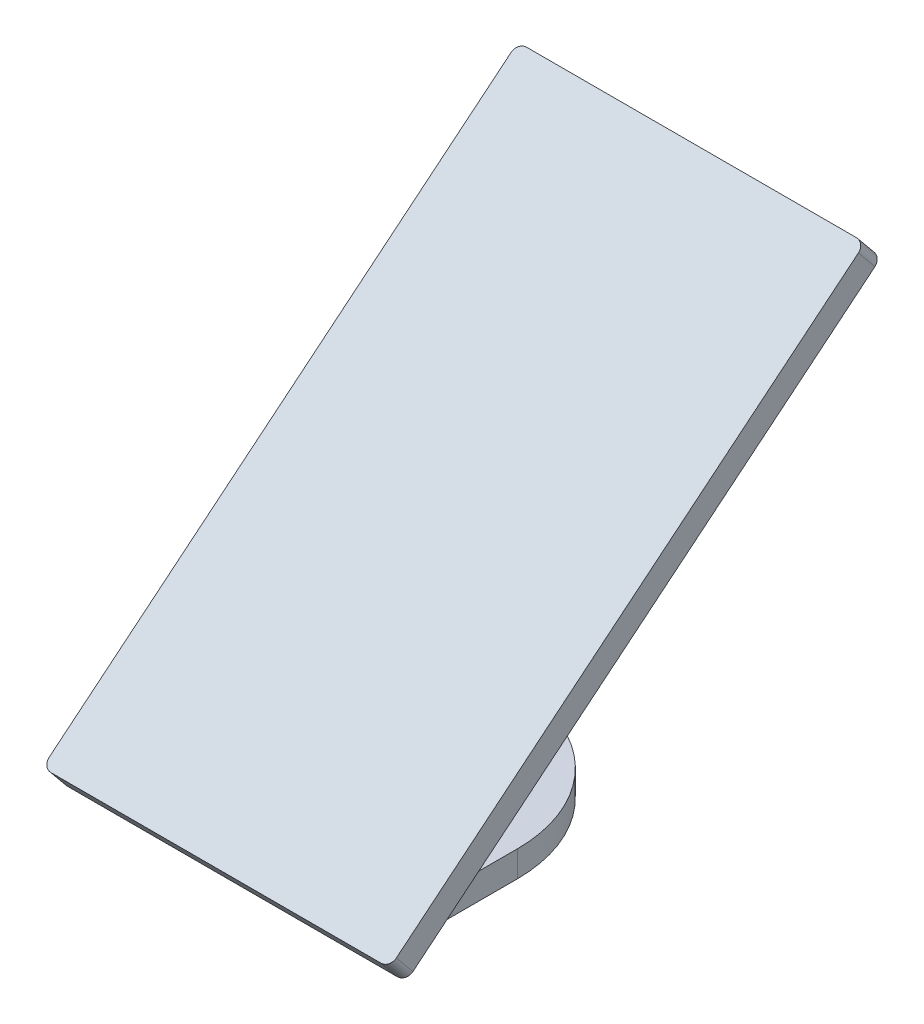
ISO-10303-21;
HEADER;
FILE_DESCRIPTION(('STEP AP214'),'2;1');
FILE_NAME('part.step','',(''),(''),'','','');
FILE_SCHEMA(('AUTOMOTIVE_DESIGN { 1 0 10303 214 1 1 1 1 }'));
ENDSEC;
DATA;
#1=APPLICATION_CONTEXT('core data for automotive mechanical design processes');
#2=APPLICATION_PROTOCOL_DEFINITION('international standard','automotive_design',2000,#1);
#3=PRODUCT_CONTEXT('',#1,'mechanical');
#4=PRODUCT('Part','Part','',(#3));
#5=PRODUCT_RELATED_PRODUCT_CATEGORY('part','',(#4));
#6=PRODUCT_DEFINITION_FORMATION('','',#4);
#7=PRODUCT_DEFINITION_CONTEXT('part definition',#1,'design');
#8=PRODUCT_DEFINITION('design','',#6,#7);
#9=PRODUCT_DEFINITION_SHAPE('','',#8);
#10=(LENGTH_UNIT() NAMED_UNIT(*) SI_UNIT(.MILLI.,.METRE.));
#11=(NAMED_UNIT(*) PLANE_ANGLE_UNIT() SI_UNIT($,.RADIAN.));
#12=(NAMED_UNIT(*) SI_UNIT($,.STERADIAN.) SOLID_ANGLE_UNIT());
#13=UNCERTAINTY_MEASURE_WITH_UNIT(LENGTH_MEASURE(1.E-05),#10,'distance_accuracy_value','');
#14=(GEOMETRIC_REPRESENTATION_CONTEXT(3) GLOBAL_UNCERTAINTY_ASSIGNED_CONTEXT((#13)) GLOBAL_UNIT_ASSIGNED_CONTEXT((#10,
#11,#12)) REPRESENTATION_CONTEXT('',''));
#15=CARTESIAN_POINT('',(0.,0.,0.));
#16=DIRECTION('',(0.,0.,1.));
#17=DIRECTION('',(1.,0.,0.));
#18=AXIS2_PLACEMENT_3D('',#15,#16,#17);
#19=CARTESIAN_POINT('',(-15.24,34.2757016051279,-29.0279220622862));
#20=DIRECTION('',(0.,-0.772733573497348,-0.634730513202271));
#21=DIRECTION('',(0.,0.634730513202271,-0.772733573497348));
#22=AXIS2_PLACEMENT_3D('',#19,#20,#21);
#23=PLANE('',#22);
#24=DIRECTION('',(-1.,0.,0.));
#25=VECTOR('',#24,1.);
#26=CARTESIAN_POINT('',(-15.24,0.,12.7));
#27=LINE('',#26,#25);
#28=CARTESIAN_POINT('',(-12.2936,0.,12.7));
#29=VERTEX_POINT('',#28);
#30=CARTESIAN_POINT('',(-14.478,0.,12.7));
#31=VERTEX_POINT('',#30);
#32=EDGE_CURVE('E278',#29,#31,#27,.T.);
#33=ORIENTED_EDGE('',*,*,#32,.T.);
#34=CARTESIAN_POINT('',(-14.478,0.483664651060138,12.111177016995));
#35=DIRECTION('',(0.,-0.772733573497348,-0.634730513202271));
#36=DIRECTION('',(0.,0.634730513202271,-0.772733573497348));
#37=AXIS2_PLACEMENT_3D('',#34,#35,#36);
#38=CIRCLE('',#37,0.762);
#39=CARTESIAN_POINT('',(-15.24,0.48366465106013,12.111177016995));
#40=VERTEX_POINT('',#39);
#41=EDGE_CURVE('E238',#31,#40,#38,.T.);
#42=ORIENTED_EDGE('',*,*,#41,.T.);
#43=DIRECTION('',(0.,0.634730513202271,-0.772733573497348));
#44=VECTOR('',#43,1.);
#45=CARTESIAN_POINT('',(-15.24,0.,12.7));
#46=LINE('',#45,#44);
#47=CARTESIAN_POINT('',(-15.24,33.7920369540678,-28.4390990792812));
#48=VERTEX_POINT('',#47);
#49=EDGE_CURVE('E202',#40,#48,#46,.T.);
#50=ORIENTED_EDGE('',*,*,#49,.T.);
#51=CARTESIAN_POINT('',(-14.478,33.7920369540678,-28.4390990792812));
#52=DIRECTION('',(0.,-0.772733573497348,-0.634730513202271));
#53=DIRECTION('',(0.,0.634730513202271,-0.772733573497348));
#54=AXIS2_PLACEMENT_3D('',#51,#52,#53);
#55=CIRCLE('',#54,0.762);
#56=CARTESIAN_POINT('',(-14.478,34.2757016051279,-29.0279220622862));
#57=VERTEX_POINT('',#56);
#58=EDGE_CURVE('E232',#48,#57,#55,.T.);
#59=ORIENTED_EDGE('',*,*,#58,.T.);
#60=DIRECTION('',(1.,0.,0.));
#61=VECTOR('',#60,1.);
#62=CARTESIAN_POINT('',(-15.24,34.2757016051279,-29.0279220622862));
#63=LINE('',#62,#61);
#64=CARTESIAN_POINT('',(-2.54,34.2757016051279,-29.0279220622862));
#65=VERTEX_POINT('',#64);
#66=EDGE_CURVE('E228',#57,#65,#63,.T.);
#67=ORIENTED_EDGE('',*,*,#66,.T.);
#68=DIRECTION('',(0.,-0.634730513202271,0.772733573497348));
#69=VECTOR('',#68,1.);
#70=CARTESIAN_POINT('',(-2.54,34.2757016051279,-29.0279220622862));
#71=LINE('',#70,#69);
#72=CARTESIAN_POINT('',(-2.54,12.9706237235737,-3.09069575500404));
#73=VERTEX_POINT('',#72);
#74=EDGE_CURVE('E183',#65,#73,#71,.T.);
#75=ORIENTED_EDGE('',*,*,#74,.T.);
#76=CARTESIAN_POINT('',(0.,10.4318976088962,0.));
#77=DIRECTION('',(0.,-0.772733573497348,-0.634730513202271));
#78=DIRECTION('',(0.,-0.634730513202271,0.772733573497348));
#79=AXIS2_PLACEMENT_3D('',#76,#77,#78);
#80=ELLIPSE('',#79,5.17707543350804,4.0005);
#81=CARTESIAN_POINT('',(2.54000000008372,12.9706237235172,-3.09069575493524));
#82=VERTEX_POINT('',#81);
#83=EDGE_CURVE('E198',#82,#73,#80,.T.);
#84=ORIENTED_EDGE('',*,*,#83,.F.);
#85=DIRECTION('',(0.,-0.634730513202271,0.772733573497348));
#86=VECTOR('',#85,1.);
#87=CARTESIAN_POINT('',(2.54,34.2757016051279,-29.0279220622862));
#88=LINE('',#87,#86);
#89=CARTESIAN_POINT('',(2.53999999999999,34.2757016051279,-29.0279220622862));
#90=VERTEX_POINT('',#89);
#91=EDGE_CURVE('E153',#90,#82,#88,.T.);
#92=ORIENTED_EDGE('',*,*,#91,.F.);
#93=CARTESIAN_POINT('',(14.478,34.2757016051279,-29.0279220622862));
#94=VERTEX_POINT('',#93);
#95=EDGE_CURVE('E219',#90,#94,#63,.T.);
#96=ORIENTED_EDGE('',*,*,#95,.T.);
#97=CARTESIAN_POINT('',(14.478,33.7920369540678,-28.4390990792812));
#98=DIRECTION('',(0.,-0.772733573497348,-0.634730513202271));
#99=DIRECTION('',(0.,0.634730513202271,-0.772733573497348));
#100=AXIS2_PLACEMENT_3D('',#97,#98,#99);
#101=CIRCLE('',#100,0.762);
#102=CARTESIAN_POINT('',(15.24,33.7920369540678,-28.4390990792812));
#103=VERTEX_POINT('',#102);
#104=EDGE_CURVE('E234',#94,#103,#101,.T.);
#105=ORIENTED_EDGE('',*,*,#104,.T.);
#106=DIRECTION('',(0.,-0.634730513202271,0.772733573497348));
#107=VECTOR('',#106,1.);
#108=CARTESIAN_POINT('',(15.24,0.,12.7));
#109=LINE('',#108,#107);
#110=CARTESIAN_POINT('',(15.24,0.48366465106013,12.111177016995));
#111=VERTEX_POINT('',#110);
#112=EDGE_CURVE('E222',#103,#111,#109,.T.);
#113=ORIENTED_EDGE('',*,*,#112,.T.);
#114=CARTESIAN_POINT('',(14.478,0.483664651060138,12.111177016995));
#115=DIRECTION('',(0.,-0.772733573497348,-0.634730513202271));
#116=DIRECTION('',(0.,0.634730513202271,-0.772733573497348));
#117=AXIS2_PLACEMENT_3D('',#114,#115,#116);
#118=CIRCLE('',#117,0.762);
#119=CARTESIAN_POINT('',(14.478,0.,12.7));
#120=VERTEX_POINT('',#119);
#121=EDGE_CURVE('E236',#111,#120,#118,.T.);
#122=ORIENTED_EDGE('',*,*,#121,.T.);
#123=CARTESIAN_POINT('',(12.2936,0.,12.7));
#124=VERTEX_POINT('',#123);
#125=EDGE_CURVE('E207',#120,#124,#27,.T.);
#126=ORIENTED_EDGE('',*,*,#125,.T.);
#127=DIRECTION('',(0.,-0.634730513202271,0.772733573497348));
#128=VECTOR('',#127,1.);
#129=CARTESIAN_POINT('',(12.2936,0.920990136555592,11.5787682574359));
#130=LINE('',#129,#128);
#131=CARTESIAN_POINT('',(12.2936,2.286,9.91697805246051));
#132=VERTEX_POINT('',#131);
#133=EDGE_CURVE('E290',#132,#124,#130,.T.);
#134=ORIENTED_EDGE('',*,*,#133,.F.);
#135=DIRECTION('',(-1.,0.,0.));
#136=VECTOR('',#135,1.);
#137=CARTESIAN_POINT('',(0.,2.286,9.91697805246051));
#138=LINE('',#137,#136);
#139=CARTESIAN_POINT('',(-12.2936,2.286,9.91697805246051));
#140=VERTEX_POINT('',#139);
#141=EDGE_CURVE('E216',#132,#140,#138,.T.);
#142=ORIENTED_EDGE('',*,*,#141,.T.);
#143=DIRECTION('',(0.,0.634730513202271,-0.772733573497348));
#144=VECTOR('',#143,1.);
#145=CARTESIAN_POINT('',(-12.2936,7.15005537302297,3.99538012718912));
#146=LINE('',#145,#144);
#147=EDGE_CURVE('E338',#29,#140,#146,.T.);
#148=ORIENTED_EDGE('',*,*,#147,.F.);
#149=EDGE_LOOP('',(#33,#42,#50,#59,#67,#75,#84,#92,#96,#105,#113,#122,#126,#134,#142,#148));
#150=FACE_BOUND('',#149,.T.);
#151=ADVANCED_FACE('F34',(#150),#23,.T.);
#152=CARTESIAN_POINT('',(0.,500000.,0.));
#153=DIRECTION('',(0.,-1.,0.));
#154=DIRECTION('',(0.,0.,-1.));
#155=AXIS2_PLACEMENT_3D('',#152,#153,#154);
#156=CYLINDRICAL_SURFACE('',#155,4.0005);
#157=DIRECTION('',(0.,-1.,0.));
#158=VECTOR('',#157,1.);
#159=CARTESIAN_POINT('',(2.54000000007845,500000.,-3.09069575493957));
#160=LINE('',#159,#158);
#161=CARTESIAN_POINT('',(2.53999999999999,2.286,-3.09069575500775));
#162=VERTEX_POINT('',#161);
#163=EDGE_CURVE('E148',#162,#82,#160,.F.);
#164=ORIENTED_EDGE('',*,*,#163,.T.);
#165=ORIENTED_EDGE('',*,*,#83,.T.);
#166=DIRECTION('',(0.,-1.,0.));
#167=VECTOR('',#166,1.);
#168=CARTESIAN_POINT('',(-2.53999999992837,500000.,-3.09069575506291));
#169=LINE('',#168,#167);
#170=CARTESIAN_POINT('',(-2.54000000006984,2.286,-3.09069575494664));
#171=VERTEX_POINT('',#170);
#172=EDGE_CURVE('E163',#171,#73,#169,.F.);
#173=ORIENTED_EDGE('',*,*,#172,.F.);
#174=CARTESIAN_POINT('',(0.,2.286,0.));
#175=DIRECTION('',(0.,1.,0.));
#176=DIRECTION('',(0.,0.,1.));
#177=AXIS2_PLACEMENT_3D('',#174,#175,#176);
#178=CIRCLE('',#177,4.0005);
#179=EDGE_CURVE('E160',#171,#162,#178,.T.);
#180=ORIENTED_EDGE('',*,*,#179,.T.);
#181=EDGE_LOOP('',(#164,#165,#173,#180));
#182=FACE_BOUND('',#181,.T.);
#183=ADVANCED_FACE('F161',(#182),#156,.T.);
#184=CARTESIAN_POINT('',(0.,2.286,0.));
#185=DIRECTION('',(0.,1.,0.));
#186=DIRECTION('',(0.,0.,1.));
#187=AXIS2_PLACEMENT_3D('',#184,#185,#186);
#188=PLANE('',#187);
#189=DIRECTION('',(0.,0.,-1.));
#190=VECTOR('',#189,1.);
#191=CARTESIAN_POINT('',(-2.54000000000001,2.286,-3.09069575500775));
#192=LINE('',#191,#190);
#193=CARTESIAN_POINT('',(-2.54000000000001,2.286,-4.0005));
#194=VERTEX_POINT('',#193);
#195=EDGE_CURVE('E51',#171,#194,#192,.T.);
#196=ORIENTED_EDGE('',*,*,#195,.T.);
#197=DIRECTION('',(1.,0.,0.));
#198=VECTOR('',#197,1.);
#199=CARTESIAN_POINT('',(-2.54000000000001,2.286,-4.0005));
#200=LINE('',#199,#198);
#201=CARTESIAN_POINT('',(2.53999999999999,2.286,-4.0005));
#202=VERTEX_POINT('',#201);
#203=EDGE_CURVE('E55',#194,#202,#200,.T.);
#204=ORIENTED_EDGE('',*,*,#203,.T.);
#205=DIRECTION('',(0.,0.,-1.));
#206=VECTOR('',#205,1.);
#207=CARTESIAN_POINT('',(2.53999999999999,2.286,-3.09069575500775));
#208=LINE('',#207,#206);
#209=EDGE_CURVE('E152',#162,#202,#208,.T.);
#210=ORIENTED_EDGE('',*,*,#209,.F.);
#211=ORIENTED_EDGE('',*,*,#179,.F.);
#212=EDGE_LOOP('',(#196,#204,#210,#211));
#213=FACE_BOUND('',#212,.T.);
#214=ORIENTED_EDGE('',*,*,#141,.F.);
#215=DIRECTION('',(0.,0.,-1.));
#216=VECTOR('',#215,1.);
#217=CARTESIAN_POINT('',(12.2936,2.286,12.7));
#218=LINE('',#217,#216);
#219=CARTESIAN_POINT('',(12.2936,2.286,0.));
#220=VERTEX_POINT('',#219);
#221=EDGE_CURVE('E307',#132,#220,#218,.T.);
#222=ORIENTED_EDGE('',*,*,#221,.T.);
#223=CARTESIAN_POINT('',(0.,2.286,0.));
#224=DIRECTION('',(0.,1.,0.));
#225=DIRECTION('',(0.,0.,1.));
#226=AXIS2_PLACEMENT_3D('',#223,#224,#225);
#227=CIRCLE('',#226,12.2936);
#228=CARTESIAN_POINT('',(-12.2936,2.286,0.));
#229=VERTEX_POINT('',#228);
#230=EDGE_CURVE('E310',#220,#229,#227,.T.);
#231=ORIENTED_EDGE('',*,*,#230,.T.);
#232=DIRECTION('',(0.,0.,1.));
#233=VECTOR('',#232,1.);
#234=CARTESIAN_POINT('',(-12.2936,2.286,0.));
#235=LINE('',#234,#233);
#236=EDGE_CURVE('E318',#229,#140,#235,.T.);
#237=ORIENTED_EDGE('',*,*,#236,.T.);
#238=EDGE_LOOP('',(#214,#222,#231,#237));
#239=FACE_BOUND('',#238,.T.);
#240=CARTESIAN_POINT('',(-8.3312,2.286,0.));
#241=DIRECTION('',(0.,1.,0.));
#242=DIRECTION('',(0.,0.,1.));
#243=AXIS2_PLACEMENT_3D('',#240,#241,#242);
#244=CIRCLE('',#243,1.1938);
#245=CARTESIAN_POINT('',(-8.3312,2.286,1.1938));
#246=VERTEX_POINT('',#245);
#247=EDGE_CURVE('E326',#246,#246,#244,.T.);
#248=ORIENTED_EDGE('',*,*,#247,.F.);
#249=EDGE_LOOP('',(#248));
#250=FACE_BOUND('',#249,.T.);
#251=CARTESIAN_POINT('',(0.,2.286,-8.3312));
#252=DIRECTION('',(0.,1.,0.));
#253=DIRECTION('',(0.,0.,1.));
#254=AXIS2_PLACEMENT_3D('',#251,#252,#253);
#255=CIRCLE('',#254,1.1938);
#256=CARTESIAN_POINT('',(0.,2.286,-7.1374));
#257=VERTEX_POINT('',#256);
#258=EDGE_CURVE('E165',#257,#257,#255,.T.);
#259=ORIENTED_EDGE('',*,*,#258,.F.);
#260=EDGE_LOOP('',(#259));
#261=FACE_BOUND('',#260,.T.);
#262=CARTESIAN_POINT('',(8.3312,2.286,0.));
#263=DIRECTION('',(0.,1.,0.));
#264=DIRECTION('',(0.,0.,1.));
#265=AXIS2_PLACEMENT_3D('',#262,#263,#264);
#266=CIRCLE('',#265,1.1938);
#267=CARTESIAN_POINT('',(8.3312,2.286,1.1938));
#268=VERTEX_POINT('',#267);
#269=EDGE_CURVE('E332',#268,#268,#266,.T.);
#270=ORIENTED_EDGE('',*,*,#269,.F.);
#271=EDGE_LOOP('',(#270));
#272=FACE_BOUND('',#271,.T.);
#273=ADVANCED_FACE('F167',(#213,#239,#250,#261,#272),#188,.T.);
#274=CARTESIAN_POINT('',(0.,0.,0.));
#275=DIRECTION('',(0.,1.,0.));
#276=DIRECTION('',(0.,0.,1.));
#277=AXIS2_PLACEMENT_3D('',#274,#275,#276);
#278=PLANE('',#277);
#279=CARTESIAN_POINT('',(-8.3312,0.,0.));
#280=DIRECTION('',(0.,1.,0.));
#281=DIRECTION('',(0.,0.,1.));
#282=AXIS2_PLACEMENT_3D('',#279,#280,#281);
#283=CIRCLE('',#282,1.1938);
#284=CARTESIAN_POINT('',(-8.3312,0.,1.1938));
#285=VERTEX_POINT('',#284);
#286=EDGE_CURVE('E329',#285,#285,#283,.T.);
#287=ORIENTED_EDGE('',*,*,#286,.T.);
#288=EDGE_LOOP('',(#287));
#289=FACE_BOUND('',#288,.T.);
#290=CARTESIAN_POINT('',(0.,0.,0.));
#291=DIRECTION('',(0.,1.,0.));
#292=DIRECTION('',(0.,0.,1.));
#293=AXIS2_PLACEMENT_3D('',#290,#291,#292);
#294=CIRCLE('',#293,12.2936);
#295=CARTESIAN_POINT('',(12.2936,0.,0.));
#296=VERTEX_POINT('',#295);
#297=CARTESIAN_POINT('',(-12.2936,0.,0.));
#298=VERTEX_POINT('',#297);
#299=EDGE_CURVE('E164',#296,#298,#294,.T.);
#300=ORIENTED_EDGE('',*,*,#299,.F.);
#301=DIRECTION('',(0.,0.,-1.));
#302=VECTOR('',#301,1.);
#303=CARTESIAN_POINT('',(12.2936,0.,12.7));
#304=LINE('',#303,#302);
#305=EDGE_CURVE('E308',#124,#296,#304,.T.);
#306=ORIENTED_EDGE('',*,*,#305,.F.);
#307=DIRECTION('',(1.,0.,0.));
#308=VECTOR('',#307,1.);
#309=CARTESIAN_POINT('',(-12.2936,0.,12.7));
#310=LINE('',#309,#308);
#311=EDGE_CURVE('E311',#29,#124,#310,.T.);
#312=ORIENTED_EDGE('',*,*,#311,.F.);
#313=DIRECTION('',(0.,0.,1.));
#314=VECTOR('',#313,1.);
#315=CARTESIAN_POINT('',(-12.2936,0.,0.));
#316=LINE('',#315,#314);
#317=EDGE_CURVE('E313',#298,#29,#316,.T.);
#318=ORIENTED_EDGE('',*,*,#317,.F.);
#319=EDGE_LOOP('',(#300,#306,#312,#318));
#320=FACE_BOUND('',#319,.T.);
#321=CARTESIAN_POINT('',(0.,0.,-8.3312));
#322=DIRECTION('',(0.,1.,0.));
#323=DIRECTION('',(0.,0.,1.));
#324=AXIS2_PLACEMENT_3D('',#321,#322,#323);
#325=CIRCLE('',#324,1.1938);
#326=CARTESIAN_POINT('',(0.,0.,-7.1374));
#327=VERTEX_POINT('',#326);
#328=EDGE_CURVE('E323',#327,#327,#325,.T.);
#329=ORIENTED_EDGE('',*,*,#328,.T.);
#330=EDGE_LOOP('',(#329));
#331=FACE_BOUND('',#330,.T.);
#332=CARTESIAN_POINT('',(8.3312,0.,0.));
#333=DIRECTION('',(0.,1.,0.));
#334=DIRECTION('',(0.,0.,1.));
#335=AXIS2_PLACEMENT_3D('',#332,#333,#334);
#336=CIRCLE('',#335,1.1938);
#337=CARTESIAN_POINT('',(8.3312,0.,1.1938));
#338=VERTEX_POINT('',#337);
#339=EDGE_CURVE('E335',#338,#338,#336,.T.);
#340=ORIENTED_EDGE('',*,*,#339,.T.);
#341=EDGE_LOOP('',(#340));
#342=FACE_BOUND('',#341,.T.);
#343=ADVANCED_FACE('F397',(#289,#320,#331,#342),#278,.F.);
#344=CARTESIAN_POINT('',(0.,2.286,0.));
#345=DIRECTION('',(0.,-1.,0.));
#346=DIRECTION('',(0.,0.,-1.));
#347=AXIS2_PLACEMENT_3D('',#344,#345,#346);
#348=CYLINDRICAL_SURFACE('',#347,12.2936);
#349=ORIENTED_EDGE('',*,*,#299,.T.);
#350=DIRECTION('',(0.,-1.,0.));
#351=VECTOR('',#350,1.);
#352=CARTESIAN_POINT('',(-12.2936,2.286,0.));
#353=LINE('',#352,#351);
#354=EDGE_CURVE('E294',#229,#298,#353,.T.);
#355=ORIENTED_EDGE('',*,*,#354,.F.);
#356=ORIENTED_EDGE('',*,*,#230,.F.);
#357=DIRECTION('',(0.,-1.,0.));
#358=VECTOR('',#357,1.);
#359=CARTESIAN_POINT('',(12.2936,2.286,0.));
#360=LINE('',#359,#358);
#361=EDGE_CURVE('E300',#220,#296,#360,.T.);
#362=ORIENTED_EDGE('',*,*,#361,.T.);
#363=EDGE_LOOP('',(#349,#355,#356,#362));
#364=FACE_BOUND('',#363,.T.);
#365=ADVANCED_FACE('F400',(#364),#348,.T.);
#366=CARTESIAN_POINT('',(-12.2936,2.286,0.));
#367=DIRECTION('',(1.,0.,0.));
#368=DIRECTION('',(0.,0.,-1.));
#369=AXIS2_PLACEMENT_3D('',#366,#367,#368);
#370=PLANE('',#369);
#371=ORIENTED_EDGE('',*,*,#317,.T.);
#372=ORIENTED_EDGE('',*,*,#147,.T.);
#373=ORIENTED_EDGE('',*,*,#236,.F.);
#374=ORIENTED_EDGE('',*,*,#354,.T.);
#375=EDGE_LOOP('',(#371,#372,#373,#374));
#376=FACE_BOUND('',#375,.T.);
#377=ADVANCED_FACE('F404',(#376),#370,.F.);
#378=CARTESIAN_POINT('',(12.2936,2.286,12.7));
#379=DIRECTION('',(-1.,0.,0.));
#380=DIRECTION('',(0.,0.,1.));
#381=AXIS2_PLACEMENT_3D('',#378,#379,#380);
#382=PLANE('',#381);
#383=ORIENTED_EDGE('',*,*,#221,.F.);
#384=ORIENTED_EDGE('',*,*,#133,.T.);
#385=ORIENTED_EDGE('',*,*,#305,.T.);
#386=ORIENTED_EDGE('',*,*,#361,.F.);
#387=EDGE_LOOP('',(#383,#384,#385,#386));
#388=FACE_BOUND('',#387,.T.);
#389=ADVANCED_FACE('F393',(#388),#382,.F.);
#390=CARTESIAN_POINT('',(0.,2.286,-8.3312));
#391=DIRECTION('',(0.,-1.,0.));
#392=DIRECTION('',(0.,0.,-1.));
#393=AXIS2_PLACEMENT_3D('',#390,#391,#392);
#394=CYLINDRICAL_SURFACE('',#393,1.1938);
#395=ORIENTED_EDGE('',*,*,#258,.T.);
#396=EDGE_LOOP('',(#395));
#397=FACE_BOUND('',#396,.T.);
#398=ORIENTED_EDGE('',*,*,#328,.F.);
#399=EDGE_LOOP('',(#398));
#400=FACE_BOUND('',#399,.T.);
#401=ADVANCED_FACE('F389',(#397,#400),#394,.F.);
#402=CARTESIAN_POINT('',(-8.3312,2.286,0.));
#403=DIRECTION('',(0.,-1.,0.));
#404=DIRECTION('',(0.,0.,-1.));
#405=AXIS2_PLACEMENT_3D('',#402,#403,#404);
#406=CYLINDRICAL_SURFACE('',#405,1.1938);
#407=ORIENTED_EDGE('',*,*,#247,.T.);
#408=EDGE_LOOP('',(#407));
#409=FACE_BOUND('',#408,.T.);
#410=ORIENTED_EDGE('',*,*,#286,.F.);
#411=EDGE_LOOP('',(#410));
#412=FACE_BOUND('',#411,.T.);
#413=ADVANCED_FACE('F385',(#409,#412),#406,.F.);
#414=CARTESIAN_POINT('',(8.3312,2.286,0.));
#415=DIRECTION('',(0.,-1.,0.));
#416=DIRECTION('',(0.,0.,-1.));
#417=AXIS2_PLACEMENT_3D('',#414,#415,#416);
#418=CYLINDRICAL_SURFACE('',#417,1.1938);
#419=ORIENTED_EDGE('',*,*,#269,.T.);
#420=EDGE_LOOP('',(#419));
#421=FACE_BOUND('',#420,.T.);
#422=ORIENTED_EDGE('',*,*,#339,.F.);
#423=EDGE_LOOP('',(#422));
#424=FACE_BOUND('',#423,.T.);
#425=ADVANCED_FACE('F382',(#421,#424),#418,.F.);
#426=CARTESIAN_POINT('',(-15.24,1.76646894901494,14.1509939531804));
#427=DIRECTION('',(-1.,0.,0.));
#428=DIRECTION('',(0.,0.,1.));
#429=AXIS2_PLACEMENT_3D('',#426,#427,#428);
#430=PLANE('',#429);
#431=ORIENTED_EDGE('',*,*,#49,.F.);
#432=DIRECTION('',(0.,-0.772733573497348,-0.634730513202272));
#433=VECTOR('',#432,1.);
#434=CARTESIAN_POINT('',(-15.24,2.25013360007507,13.5621709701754));
#435=LINE('',#434,#433);
#436=CARTESIAN_POINT('',(-15.24,2.25013360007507,13.5621709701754));
#437=VERTEX_POINT('',#436);
#438=EDGE_CURVE('E243',#40,#437,#435,.F.);
#439=ORIENTED_EDGE('',*,*,#438,.T.);
#440=DIRECTION('',(0.,0.634730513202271,-0.772733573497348));
#441=VECTOR('',#440,1.);
#442=CARTESIAN_POINT('',(-15.24,1.76646894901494,14.1509939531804));
#443=LINE('',#442,#441);
#444=CARTESIAN_POINT('',(-15.24,35.5585059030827,-26.9881051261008));
#445=VERTEX_POINT('',#444);
#446=EDGE_CURVE('E203',#437,#445,#443,.T.);
#447=ORIENTED_EDGE('',*,*,#446,.T.);
#448=DIRECTION('',(0.,-0.772733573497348,-0.634730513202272));
#449=VECTOR('',#448,1.);
#450=CARTESIAN_POINT('',(-15.24,35.5585059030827,-26.9881051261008));
#451=LINE('',#450,#449);
#452=EDGE_CURVE('E240',#445,#48,#451,.T.);
#453=ORIENTED_EDGE('',*,*,#452,.T.);
#454=EDGE_LOOP('',(#431,#439,#447,#453));
#455=FACE_BOUND('',#454,.T.);
#456=ADVANCED_FACE('F273',(#455),#430,.T.);
#457=CARTESIAN_POINT('',(-15.24,1.76646894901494,14.1509939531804));
#458=DIRECTION('',(0.,-0.634730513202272,0.772733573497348));
#459=DIRECTION('',(0.,-0.772733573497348,-0.634730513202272));
#460=AXIS2_PLACEMENT_3D('',#457,#458,#459);
#461=PLANE('',#460);
#462=DIRECTION('',(-1.,0.,0.));
#463=VECTOR('',#462,1.);
#464=CARTESIAN_POINT('',(-15.24,1.76646894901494,14.1509939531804));
#465=LINE('',#464,#463);
#466=CARTESIAN_POINT('',(14.478,1.76646894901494,14.1509939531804));
#467=VERTEX_POINT('',#466);
#468=CARTESIAN_POINT('',(-14.478,1.76646894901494,14.1509939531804));
#469=VERTEX_POINT('',#468);
#470=EDGE_CURVE('E213',#467,#469,#465,.T.);
#471=ORIENTED_EDGE('',*,*,#470,.T.);
#472=DIRECTION('',(0.,-0.772733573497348,-0.634730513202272));
#473=VECTOR('',#472,1.);
#474=CARTESIAN_POINT('',(-14.478,1.76646894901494,14.1509939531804));
#475=LINE('',#474,#473);
#476=EDGE_CURVE('E231',#469,#31,#475,.T.);
#477=ORIENTED_EDGE('',*,*,#476,.T.);
#478=ORIENTED_EDGE('',*,*,#32,.F.);
#479=ORIENTED_EDGE('',*,*,#311,.T.);
#480=ORIENTED_EDGE('',*,*,#125,.F.);
#481=DIRECTION('',(0.,-0.772733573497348,-0.634730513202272));
#482=VECTOR('',#481,1.);
#483=CARTESIAN_POINT('',(14.478,1.76646894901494,14.1509939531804));
#484=LINE('',#483,#482);
#485=EDGE_CURVE('E289',#120,#467,#484,.F.);
#486=ORIENTED_EDGE('',*,*,#485,.T.);
#487=EDGE_LOOP('',(#471,#477,#478,#479,#480,#486));
#488=FACE_BOUND('',#487,.T.);
#489=ADVANCED_FACE('F285',(#488),#461,.T.);
#490=CARTESIAN_POINT('',(15.24,1.76646894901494,14.1509939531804));
#491=DIRECTION('',(1.,0.,0.));
#492=DIRECTION('',(0.,0.,-1.));
#493=AXIS2_PLACEMENT_3D('',#490,#491,#492);
#494=PLANE('',#493);
#495=DIRECTION('',(0.,-0.634730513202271,0.772733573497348));
#496=VECTOR('',#495,1.);
#497=CARTESIAN_POINT('',(15.24,1.76646894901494,14.1509939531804));
#498=LINE('',#497,#496);
#499=CARTESIAN_POINT('',(15.24,35.5585059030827,-26.9881051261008));
#500=VERTEX_POINT('',#499);
#501=CARTESIAN_POINT('',(15.24,2.25013360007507,13.5621709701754));
#502=VERTEX_POINT('',#501);
#503=EDGE_CURVE('E210',#500,#502,#498,.T.);
#504=ORIENTED_EDGE('',*,*,#503,.T.);
#505=DIRECTION('',(0.,-0.772733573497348,-0.634730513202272));
#506=VECTOR('',#505,1.);
#507=CARTESIAN_POINT('',(15.24,2.25013360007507,13.5621709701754));
#508=LINE('',#507,#506);
#509=EDGE_CURVE('E255',#502,#111,#508,.T.);
#510=ORIENTED_EDGE('',*,*,#509,.T.);
#511=ORIENTED_EDGE('',*,*,#112,.F.);
#512=DIRECTION('',(0.,-0.772733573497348,-0.634730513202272));
#513=VECTOR('',#512,1.);
#514=CARTESIAN_POINT('',(15.24,35.5585059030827,-26.9881051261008));
#515=LINE('',#514,#513);
#516=EDGE_CURVE('E253',#103,#500,#515,.F.);
#517=ORIENTED_EDGE('',*,*,#516,.T.);
#518=EDGE_LOOP('',(#504,#510,#511,#517));
#519=FACE_BOUND('',#518,.T.);
#520=ADVANCED_FACE('F348',(#519),#494,.T.);
#521=CARTESIAN_POINT('',(-15.24,36.0421705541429,-27.5769281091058));
#522=DIRECTION('',(0.,0.634730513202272,-0.772733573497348));
#523=DIRECTION('',(0.,0.772733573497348,0.634730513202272));
#524=AXIS2_PLACEMENT_3D('',#521,#522,#523);
#525=PLANE('',#524);
#526=DIRECTION('',(1.,0.,0.));
#527=VECTOR('',#526,1.);
#528=CARTESIAN_POINT('',(-15.24,36.0421705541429,-27.5769281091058));
#529=LINE('',#528,#527);
#530=CARTESIAN_POINT('',(-14.478,36.0421705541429,-27.5769281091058));
#531=VERTEX_POINT('',#530);
#532=CARTESIAN_POINT('',(14.478,36.0421705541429,-27.5769281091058));
#533=VERTEX_POINT('',#532);
#534=EDGE_CURVE('E206',#531,#533,#529,.T.);
#535=ORIENTED_EDGE('',*,*,#534,.T.);
#536=DIRECTION('',(0.,-0.772733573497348,-0.634730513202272));
#537=VECTOR('',#536,1.);
#538=CARTESIAN_POINT('',(14.478,36.0421705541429,-27.5769281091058));
#539=LINE('',#538,#537);
#540=EDGE_CURVE('E12',#533,#94,#539,.T.);
#541=ORIENTED_EDGE('',*,*,#540,.T.);
#542=ORIENTED_EDGE('',*,*,#95,.F.);
#543=DIRECTION('',(-1.,0.,0.));
#544=VECTOR('',#543,1.);
#545=CARTESIAN_POINT('',(2.54,34.2757016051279,-29.0279220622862));
#546=LINE('',#545,#544);
#547=EDGE_CURVE('E157',#90,#65,#546,.T.);
#548=ORIENTED_EDGE('',*,*,#547,.T.);
#549=ORIENTED_EDGE('',*,*,#66,.F.);
#550=DIRECTION('',(0.,-0.772733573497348,-0.634730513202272));
#551=VECTOR('',#550,1.);
#552=CARTESIAN_POINT('',(-14.478,36.0421705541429,-27.5769281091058));
#553=LINE('',#552,#551);
#554=EDGE_CURVE('E43',#57,#531,#553,.F.);
#555=ORIENTED_EDGE('',*,*,#554,.T.);
#556=EDGE_LOOP('',(#535,#541,#542,#548,#549,#555));
#557=FACE_BOUND('',#556,.T.);
#558=ADVANCED_FACE('F261',(#557),#525,.T.);
#559=CARTESIAN_POINT('',(-15.24,36.0421705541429,-27.5769281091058));
#560=DIRECTION('',(0.,-0.772733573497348,-0.634730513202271));
#561=DIRECTION('',(0.,0.634730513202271,-0.772733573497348));
#562=AXIS2_PLACEMENT_3D('',#559,#560,#561);
#563=PLANE('',#562);
#564=ORIENTED_EDGE('',*,*,#446,.F.);
#565=CARTESIAN_POINT('',(-14.478,2.25013360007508,13.5621709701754));
#566=DIRECTION('',(0.,-0.772733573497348,-0.634730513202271));
#567=DIRECTION('',(0.,0.634730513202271,-0.772733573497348));
#568=AXIS2_PLACEMENT_3D('',#565,#566,#567);
#569=CIRCLE('',#568,0.762);
#570=EDGE_CURVE('E251',#437,#469,#569,.F.);
#571=ORIENTED_EDGE('',*,*,#570,.T.);
#572=ORIENTED_EDGE('',*,*,#470,.F.);
#573=CARTESIAN_POINT('',(14.478,2.25013360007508,13.5621709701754));
#574=DIRECTION('',(0.,-0.772733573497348,-0.634730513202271));
#575=DIRECTION('',(0.,0.634730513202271,-0.772733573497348));
#576=AXIS2_PLACEMENT_3D('',#573,#574,#575);
#577=CIRCLE('',#576,0.762);
#578=EDGE_CURVE('E249',#467,#502,#577,.F.);
#579=ORIENTED_EDGE('',*,*,#578,.T.);
#580=ORIENTED_EDGE('',*,*,#503,.F.);
#581=CARTESIAN_POINT('',(14.478,35.5585059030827,-26.9881051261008));
#582=DIRECTION('',(0.,-0.772733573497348,-0.634730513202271));
#583=DIRECTION('',(0.,0.634730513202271,-0.772733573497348));
#584=AXIS2_PLACEMENT_3D('',#581,#582,#583);
#585=CIRCLE('',#584,0.762);
#586=EDGE_CURVE('E247',#500,#533,#585,.F.);
#587=ORIENTED_EDGE('',*,*,#586,.T.);
#588=ORIENTED_EDGE('',*,*,#534,.F.);
#589=CARTESIAN_POINT('',(-14.478,35.5585059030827,-26.9881051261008));
#590=DIRECTION('',(0.,-0.772733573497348,-0.634730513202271));
#591=DIRECTION('',(0.,0.634730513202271,-0.772733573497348));
#592=AXIS2_PLACEMENT_3D('',#589,#590,#591);
#593=CIRCLE('',#592,0.762);
#594=EDGE_CURVE('E245',#531,#445,#593,.F.);
#595=ORIENTED_EDGE('',*,*,#594,.T.);
#596=EDGE_LOOP('',(#564,#571,#572,#579,#580,#587,#588,#595));
#597=FACE_BOUND('',#596,.T.);
#598=ADVANCED_FACE('F267',(#597),#563,.F.);
#599=CARTESIAN_POINT('',(2.54,34.2757016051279,-29.0279220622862));
#600=DIRECTION('',(-1.,0.,0.));
#601=DIRECTION('',(0.,0.,1.));
#602=AXIS2_PLACEMENT_3D('',#599,#600,#601);
#603=PLANE('',#602);
#604=ORIENTED_EDGE('',*,*,#163,.F.);
#605=ORIENTED_EDGE('',*,*,#209,.T.);
#606=DIRECTION('',(0.,0.787600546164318,-0.616186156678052));
#607=VECTOR('',#606,1.);
#608=CARTESIAN_POINT('',(2.53999999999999,2.286,-4.0005));
#609=LINE('',#608,#607);
#610=EDGE_CURVE('E170',#202,#90,#609,.T.);
#611=ORIENTED_EDGE('',*,*,#610,.T.);
#612=ORIENTED_EDGE('',*,*,#91,.T.);
#613=EDGE_LOOP('',(#604,#605,#611,#612));
#614=FACE_BOUND('',#613,.T.);
#615=ADVANCED_FACE('F150',(#614),#603,.F.);
#616=CARTESIAN_POINT('',(-2.54,34.2757016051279,-29.0279220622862));
#617=DIRECTION('',(-1.,0.,0.));
#618=DIRECTION('',(0.,0.,1.));
#619=AXIS2_PLACEMENT_3D('',#616,#617,#618);
#620=PLANE('',#619);
#621=ORIENTED_EDGE('',*,*,#74,.F.);
#622=DIRECTION('',(0.,0.787600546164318,-0.616186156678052));
#623=VECTOR('',#622,1.);
#624=CARTESIAN_POINT('',(-2.54000000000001,2.286,-4.0005));
#625=LINE('',#624,#623);
#626=EDGE_CURVE('E169',#194,#65,#625,.T.);
#627=ORIENTED_EDGE('',*,*,#626,.F.);
#628=ORIENTED_EDGE('',*,*,#195,.F.);
#629=ORIENTED_EDGE('',*,*,#172,.T.);
#630=EDGE_LOOP('',(#621,#627,#628,#629));
#631=FACE_BOUND('',#630,.T.);
#632=ADVANCED_FACE('F356',(#631),#620,.T.);
#633=CARTESIAN_POINT('',(-14.478,2.25013360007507,13.5621709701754));
#634=DIRECTION('',(0.,-0.772733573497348,-0.634730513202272));
#635=DIRECTION('',(0.,0.634730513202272,-0.772733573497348));
#636=AXIS2_PLACEMENT_3D('',#633,#634,#635);
#637=CYLINDRICAL_SURFACE('',#636,0.762);
#638=ORIENTED_EDGE('',*,*,#570,.F.);
#639=ORIENTED_EDGE('',*,*,#438,.F.);
#640=ORIENTED_EDGE('',*,*,#41,.F.);
#641=ORIENTED_EDGE('',*,*,#476,.F.);
#642=EDGE_LOOP('',(#638,#639,#640,#641));
#643=FACE_BOUND('',#642,.T.);
#644=ADVANCED_FACE('F283',(#643),#637,.T.);
#645=CARTESIAN_POINT('',(14.478,2.25013360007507,13.5621709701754));
#646=DIRECTION('',(0.,-0.772733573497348,-0.634730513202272));
#647=DIRECTION('',(0.,0.634730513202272,-0.772733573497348));
#648=AXIS2_PLACEMENT_3D('',#645,#646,#647);
#649=CYLINDRICAL_SURFACE('',#648,0.762);
#650=ORIENTED_EDGE('',*,*,#578,.F.);
#651=ORIENTED_EDGE('',*,*,#485,.F.);
#652=ORIENTED_EDGE('',*,*,#121,.F.);
#653=ORIENTED_EDGE('',*,*,#509,.F.);
#654=EDGE_LOOP('',(#650,#651,#652,#653));
#655=FACE_BOUND('',#654,.T.);
#656=ADVANCED_FACE('F413',(#655),#649,.T.);
#657=CARTESIAN_POINT('',(14.478,35.5585059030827,-26.9881051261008));
#658=DIRECTION('',(0.,-0.772733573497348,-0.634730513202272));
#659=DIRECTION('',(0.,0.634730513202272,-0.772733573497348));
#660=AXIS2_PLACEMENT_3D('',#657,#658,#659);
#661=CYLINDRICAL_SURFACE('',#660,0.762);
#662=ORIENTED_EDGE('',*,*,#586,.F.);
#663=ORIENTED_EDGE('',*,*,#516,.F.);
#664=ORIENTED_EDGE('',*,*,#104,.F.);
#665=ORIENTED_EDGE('',*,*,#540,.F.);
#666=EDGE_LOOP('',(#662,#663,#664,#665));
#667=FACE_BOUND('',#666,.T.);
#668=ADVANCED_FACE('F351',(#667),#661,.T.);
#669=CARTESIAN_POINT('',(-14.478,35.5585059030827,-26.9881051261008));
#670=DIRECTION('',(0.,-0.772733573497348,-0.634730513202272));
#671=DIRECTION('',(0.,0.634730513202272,-0.772733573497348));
#672=AXIS2_PLACEMENT_3D('',#669,#670,#671);
#673=CYLINDRICAL_SURFACE('',#672,0.762);
#674=ORIENTED_EDGE('',*,*,#594,.F.);
#675=ORIENTED_EDGE('',*,*,#554,.F.);
#676=ORIENTED_EDGE('',*,*,#58,.F.);
#677=ORIENTED_EDGE('',*,*,#452,.F.);
#678=EDGE_LOOP('',(#674,#675,#676,#677));
#679=FACE_BOUND('',#678,.T.);
#680=ADVANCED_FACE('F36',(#679),#673,.T.);
#681=CARTESIAN_POINT('',(-2.54000000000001,2.286,-4.0005));
#682=DIRECTION('',(0.,-0.616186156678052,-0.787600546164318));
#683=DIRECTION('',(0.,0.787600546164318,-0.616186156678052));
#684=AXIS2_PLACEMENT_3D('',#681,#682,#683);
#685=PLANE('',#684);
#686=ORIENTED_EDGE('',*,*,#610,.F.);
#687=ORIENTED_EDGE('',*,*,#203,.F.);
#688=ORIENTED_EDGE('',*,*,#626,.T.);
#689=ORIENTED_EDGE('',*,*,#547,.F.);
#690=EDGE_LOOP('',(#686,#687,#688,#689));
#691=FACE_BOUND('',#690,.T.);
#692=ADVANCED_FACE('F359',(#691),#685,.T.);
#693=CLOSED_SHELL('',(#151,#183,#273,#343,#365,#377,#389,#401,#413,#425,#456,#489,#520,#558,
#598,#615,#632,#644,#656,#668,#680,#692));
#694=MANIFOLD_SOLID_BREP('B2',#693);
#695=ADVANCED_BREP_SHAPE_REPRESENTATION('',(#18,#694),#14);
#696=SHAPE_DEFINITION_REPRESENTATION(#9,#695);
ENDSEC;
END-ISO-10303-21;
